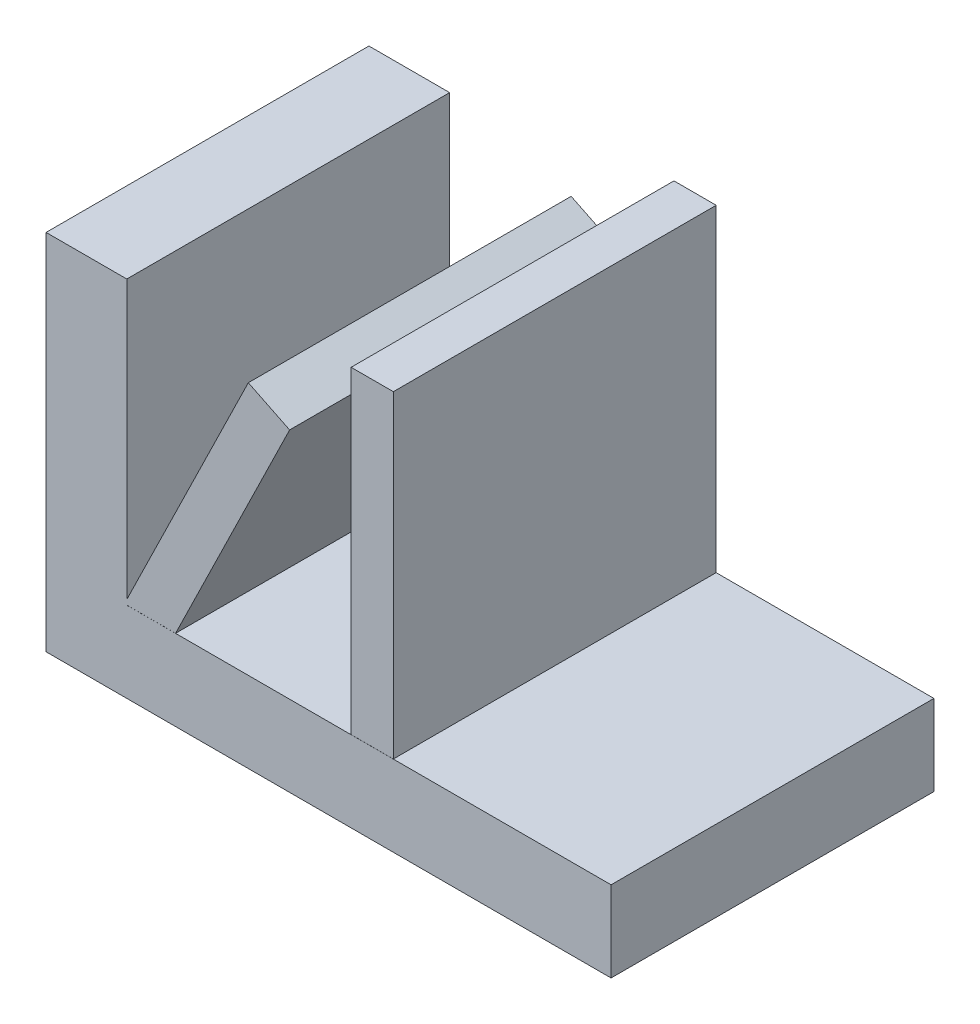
ISO-10303-21;
HEADER;
FILE_DESCRIPTION(('STEP AP214'),'2;1');
FILE_NAME('part.step','',(''),(''),'','','');
FILE_SCHEMA(('AUTOMOTIVE_DESIGN { 1 0 10303 214 1 1 1 1 }'));
ENDSEC;
DATA;
#1=APPLICATION_CONTEXT('core data for automotive mechanical design processes');
#2=APPLICATION_PROTOCOL_DEFINITION('international standard','automotive_design',2000,#1);
#3=PRODUCT_CONTEXT('',#1,'mechanical');
#4=PRODUCT('Part','Part','',(#3));
#5=PRODUCT_RELATED_PRODUCT_CATEGORY('part','',(#4));
#6=PRODUCT_DEFINITION_FORMATION('','',#4);
#7=PRODUCT_DEFINITION_CONTEXT('part definition',#1,'design');
#8=PRODUCT_DEFINITION('design','',#6,#7);
#9=PRODUCT_DEFINITION_SHAPE('','',#8);
#10=(LENGTH_UNIT() NAMED_UNIT(*) SI_UNIT(.MILLI.,.METRE.));
#11=(NAMED_UNIT(*) PLANE_ANGLE_UNIT() SI_UNIT($,.RADIAN.));
#12=(NAMED_UNIT(*) SI_UNIT($,.STERADIAN.) SOLID_ANGLE_UNIT());
#13=UNCERTAINTY_MEASURE_WITH_UNIT(LENGTH_MEASURE(1.E-05),#10,'distance_accuracy_value','');
#14=(GEOMETRIC_REPRESENTATION_CONTEXT(3) GLOBAL_UNCERTAINTY_ASSIGNED_CONTEXT((#13)) GLOBAL_UNIT_ASSIGNED_CONTEXT((#10,
#11,#12)) REPRESENTATION_CONTEXT('',''));
#15=CARTESIAN_POINT('',(0.,0.,0.));
#16=DIRECTION('',(0.,0.,1.));
#17=DIRECTION('',(1.,0.,0.));
#18=AXIS2_PLACEMENT_3D('',#15,#16,#17);
#19=CARTESIAN_POINT('',(43.0249221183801,10.00965732,20.));
#20=DIRECTION('',(-1.,0.,0.));
#21=DIRECTION('',(0.,0.,1.));
#22=AXIS2_PLACEMENT_3D('',#19,#20,#21);
#23=PLANE('',#22);
#24=DIRECTION('',(0.,1.,0.));
#25=VECTOR('',#24,1.);
#26=CARTESIAN_POINT('',(43.0249221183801,10.00965732,-20.));
#27=LINE('',#26,#25);
#28=CARTESIAN_POINT('',(43.0249221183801,10.00965732,-20.));
#29=VERTEX_POINT('',#28);
#30=CARTESIAN_POINT('',(43.0249221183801,49.4236760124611,-20.));
#31=VERTEX_POINT('',#30);
#32=EDGE_CURVE('E87',#29,#31,#27,.T.);
#33=ORIENTED_EDGE('',*,*,#32,.T.);
#34=DIRECTION('',(0.,0.,-1.));
#35=VECTOR('',#34,1.);
#36=CARTESIAN_POINT('',(43.0249221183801,49.4236760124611,20.));
#37=LINE('',#36,#35);
#38=CARTESIAN_POINT('',(43.0249221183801,49.4236760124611,20.));
#39=VERTEX_POINT('',#38);
#40=EDGE_CURVE('E12',#39,#31,#37,.T.);
#41=ORIENTED_EDGE('',*,*,#40,.F.);
#42=DIRECTION('',(0.,1.,0.));
#43=VECTOR('',#42,1.);
#44=CARTESIAN_POINT('',(43.0249221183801,10.00965732,20.));
#45=LINE('',#44,#43);
#46=CARTESIAN_POINT('',(43.0249221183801,10.00965732,20.));
#47=VERTEX_POINT('',#46);
#48=EDGE_CURVE('E105',#47,#39,#45,.T.);
#49=ORIENTED_EDGE('',*,*,#48,.F.);
#50=DIRECTION('',(0.,0.,-1.));
#51=VECTOR('',#50,1.);
#52=CARTESIAN_POINT('',(43.0249221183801,10.00965732,20.));
#53=LINE('',#52,#51);
#54=EDGE_CURVE('E99',#47,#29,#53,.T.);
#55=ORIENTED_EDGE('',*,*,#54,.T.);
#56=EDGE_LOOP('',(#33,#41,#49,#55));
#57=FACE_BOUND('',#56,.T.);
#58=ADVANCED_FACE('F43',(#57),#23,.F.);
#59=CARTESIAN_POINT('',(43.0249221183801,49.4236760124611,20.));
#60=DIRECTION('',(0.,-1.,0.));
#61=DIRECTION('',(0.,0.,-1.));
#62=AXIS2_PLACEMENT_3D('',#59,#60,#61);
#63=PLANE('',#62);
#64=DIRECTION('',(-1.,0.,0.));
#65=VECTOR('',#64,1.);
#66=CARTESIAN_POINT('',(43.0249221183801,49.4236760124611,-20.));
#67=LINE('',#66,#65);
#68=CARTESIAN_POINT('',(37.791277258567,49.4236760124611,-20.));
#69=VERTEX_POINT('',#68);
#70=EDGE_CURVE('E83',#31,#69,#67,.T.);
#71=ORIENTED_EDGE('',*,*,#70,.T.);
#72=DIRECTION('',(0.,0.,-1.));
#73=VECTOR('',#72,1.);
#74=CARTESIAN_POINT('',(37.791277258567,49.4236760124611,20.));
#75=LINE('',#74,#73);
#76=CARTESIAN_POINT('',(37.791277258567,49.4236760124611,20.));
#77=VERTEX_POINT('',#76);
#78=EDGE_CURVE('E50',#77,#69,#75,.T.);
#79=ORIENTED_EDGE('',*,*,#78,.F.);
#80=DIRECTION('',(-1.,0.,0.));
#81=VECTOR('',#80,1.);
#82=CARTESIAN_POINT('',(43.0249221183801,49.4236760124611,20.));
#83=LINE('',#82,#81);
#84=EDGE_CURVE('E95',#39,#77,#83,.T.);
#85=ORIENTED_EDGE('',*,*,#84,.F.);
#86=ORIENTED_EDGE('',*,*,#40,.T.);
#87=EDGE_LOOP('',(#71,#79,#85,#86));
#88=FACE_BOUND('',#87,.T.);
#89=ADVANCED_FACE('F94',(#88),#63,.F.);
#90=CARTESIAN_POINT('',(37.791277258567,10.00965732,20.));
#91=DIRECTION('',(1.,0.,0.));
#92=DIRECTION('',(0.,0.,-1.));
#93=AXIS2_PLACEMENT_3D('',#90,#91,#92);
#94=PLANE('',#93);
#95=DIRECTION('',(0.,-1.,0.));
#96=VECTOR('',#95,1.);
#97=CARTESIAN_POINT('',(37.791277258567,10.00965732,-20.));
#98=LINE('',#97,#96);
#99=CARTESIAN_POINT('',(37.791277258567,10.00965732,-20.));
#100=VERTEX_POINT('',#99);
#101=EDGE_CURVE('E88',#69,#100,#98,.T.);
#102=ORIENTED_EDGE('',*,*,#101,.T.);
#103=DIRECTION('',(0.,0.,-1.));
#104=VECTOR('',#103,1.);
#105=CARTESIAN_POINT('',(37.791277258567,10.00965732,20.));
#106=LINE('',#105,#104);
#107=CARTESIAN_POINT('',(37.791277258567,10.00965732,20.));
#108=VERTEX_POINT('',#107);
#109=EDGE_CURVE('E111',#108,#100,#106,.T.);
#110=ORIENTED_EDGE('',*,*,#109,.F.);
#111=DIRECTION('',(0.,-1.,0.));
#112=VECTOR('',#111,1.);
#113=CARTESIAN_POINT('',(37.791277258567,10.00965732,20.));
#114=LINE('',#113,#112);
#115=EDGE_CURVE('E62',#77,#108,#114,.T.);
#116=ORIENTED_EDGE('',*,*,#115,.F.);
#117=ORIENTED_EDGE('',*,*,#78,.T.);
#118=EDGE_LOOP('',(#102,#110,#116,#117));
#119=FACE_BOUND('',#118,.T.);
#120=ADVANCED_FACE('F114',(#119),#94,.F.);
#121=CARTESIAN_POINT('',(43.0249221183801,10.00965732,20.));
#122=DIRECTION('',(0.,1.,0.));
#123=DIRECTION('',(-1.,0.,0.));
#124=AXIS2_PLACEMENT_3D('',#121,#122,#123);
#125=PLANE('',#124);
#126=DIRECTION('',(1.,0.,0.));
#127=VECTOR('',#126,1.);
#128=CARTESIAN_POINT('',(43.0249221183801,10.00965732,-20.));
#129=LINE('',#128,#127);
#130=EDGE_CURVE('E103',#100,#29,#129,.T.);
#131=ORIENTED_EDGE('',*,*,#130,.T.);
#132=ORIENTED_EDGE('',*,*,#54,.F.);
#133=DIRECTION('',(1.,0.,0.));
#134=VECTOR('',#133,1.);
#135=CARTESIAN_POINT('',(43.0249221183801,10.00965732,20.));
#136=LINE('',#135,#134);
#137=EDGE_CURVE('E57',#108,#47,#136,.T.);
#138=ORIENTED_EDGE('',*,*,#137,.F.);
#139=ORIENTED_EDGE('',*,*,#109,.T.);
#140=EDGE_LOOP('',(#131,#132,#138,#139));
#141=FACE_BOUND('',#140,.T.);
#142=ADVANCED_FACE('F116',(#141),#125,.F.);
#143=CARTESIAN_POINT('',(43.0249221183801,49.4236760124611,20.));
#144=DIRECTION('',(0.,0.,1.));
#145=DIRECTION('',(1.,0.,0.));
#146=AXIS2_PLACEMENT_3D('',#143,#144,#145);
#147=PLANE('',#146);
#148=ORIENTED_EDGE('',*,*,#48,.T.);
#149=ORIENTED_EDGE('',*,*,#84,.T.);
#150=ORIENTED_EDGE('',*,*,#115,.T.);
#151=ORIENTED_EDGE('',*,*,#137,.T.);
#152=EDGE_LOOP('',(#148,#149,#150,#151));
#153=FACE_BOUND('',#152,.T.);
#154=ADVANCED_FACE('F117',(#153),#147,.T.);
#155=CARTESIAN_POINT('',(43.0249221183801,49.4236760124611,-20.));
#156=DIRECTION('',(0.,0.,1.));
#157=DIRECTION('',(1.,0.,0.));
#158=AXIS2_PLACEMENT_3D('',#155,#156,#157);
#159=PLANE('',#158);
#160=ORIENTED_EDGE('',*,*,#32,.F.);
#161=ORIENTED_EDGE('',*,*,#130,.F.);
#162=ORIENTED_EDGE('',*,*,#101,.F.);
#163=ORIENTED_EDGE('',*,*,#70,.F.);
#164=EDGE_LOOP('',(#160,#161,#162,#163));
#165=FACE_BOUND('',#164,.T.);
#166=ADVANCED_FACE('F84',(#165),#159,.F.);
#167=CLOSED_SHELL('',(#58,#89,#120,#142,#154,#166));
#168=MANIFOLD_SOLID_BREP('B2',#167);
#169=CARTESIAN_POINT('',(10.,45.,20.));
#170=DIRECTION('',(-1.,0.,0.));
#171=DIRECTION('',(0.,-1.,0.));
#172=AXIS2_PLACEMENT_3D('',#169,#170,#171);
#173=PLANE('',#172);
#174=DIRECTION('',(0.,0.,-1.));
#175=VECTOR('',#174,1.);
#176=CARTESIAN_POINT('',(10.,10.00965732,20.));
#177=LINE('',#176,#175);
#178=CARTESIAN_POINT('',(10.,10.00965732,20.));
#179=VERTEX_POINT('',#178);
#180=CARTESIAN_POINT('',(10.,10.00965732,-20.));
#181=VERTEX_POINT('',#180);
#182=EDGE_CURVE('E190',#179,#181,#177,.T.);
#183=ORIENTED_EDGE('',*,*,#182,.F.);
#184=DIRECTION('',(0.,1.,0.));
#185=VECTOR('',#184,1.);
#186=CARTESIAN_POINT('',(10.,45.,20.));
#187=LINE('',#186,#185);
#188=CARTESIAN_POINT('',(10.,10.,20.));
#189=VERTEX_POINT('',#188);
#190=EDGE_CURVE('E305',#189,#179,#187,.T.);
#191=ORIENTED_EDGE('',*,*,#190,.F.);
#192=DIRECTION('',(0.,0.,-1.));
#193=VECTOR('',#192,1.);
#194=CARTESIAN_POINT('',(10.,10.,20.));
#195=LINE('',#194,#193);
#196=CARTESIAN_POINT('',(10.,10.,-20.));
#197=VERTEX_POINT('',#196);
#198=EDGE_CURVE('E315',#189,#197,#195,.T.);
#199=ORIENTED_EDGE('',*,*,#198,.T.);
#200=DIRECTION('',(0.,1.,0.));
#201=VECTOR('',#200,1.);
#202=CARTESIAN_POINT('',(10.,45.,-20.));
#203=LINE('',#202,#201);
#204=EDGE_CURVE('E292',#197,#181,#203,.T.);
#205=ORIENTED_EDGE('',*,*,#204,.T.);
#206=EDGE_LOOP('',(#183,#191,#199,#205));
#207=FACE_BOUND('',#206,.T.);
#208=ADVANCED_FACE('F167',(#207),#173,.F.);
#209=DIRECTION('',(0.,0.,1.));
#210=VECTOR('',#209,1.);
#211=CARTESIAN_POINT('',(10.,10.6147636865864,20.));
#212=LINE('',#211,#210);
#213=CARTESIAN_POINT('',(9.99999999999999,10.6147636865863,-20.));
#214=VERTEX_POINT('',#213);
#215=CARTESIAN_POINT('',(10.,10.6147636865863,20.));
#216=VERTEX_POINT('',#215);
#217=EDGE_CURVE('E273',#214,#216,#212,.T.);
#218=ORIENTED_EDGE('',*,*,#217,.F.);
#219=CARTESIAN_POINT('',(10.,45.,-20.));
#220=VERTEX_POINT('',#219);
#221=EDGE_CURVE('E291',#214,#220,#203,.T.);
#222=ORIENTED_EDGE('',*,*,#221,.T.);
#223=DIRECTION('',(0.,0.,-1.));
#224=VECTOR('',#223,1.);
#225=CARTESIAN_POINT('',(10.,45.,20.));
#226=LINE('',#225,#224);
#227=CARTESIAN_POINT('',(10.,45.,20.));
#228=VERTEX_POINT('',#227);
#229=EDGE_CURVE('E312',#228,#220,#226,.T.);
#230=ORIENTED_EDGE('',*,*,#229,.F.);
#231=EDGE_CURVE('E182',#216,#228,#187,.T.);
#232=ORIENTED_EDGE('',*,*,#231,.F.);
#233=EDGE_LOOP('',(#218,#222,#230,#232));
#234=FACE_BOUND('',#233,.T.);
#235=ADVANCED_FACE('F356',(#234),#173,.F.);
#236=CARTESIAN_POINT('',(0.,45.,20.));
#237=DIRECTION('',(1.,0.,0.));
#238=DIRECTION('',(0.,1.,0.));
#239=AXIS2_PLACEMENT_3D('',#236,#237,#238);
#240=PLANE('',#239);
#241=DIRECTION('',(0.,-1.,0.));
#242=VECTOR('',#241,1.);
#243=CARTESIAN_POINT('',(0.,45.,-20.));
#244=LINE('',#243,#242);
#245=CARTESIAN_POINT('',(0.,45.,-20.));
#246=VERTEX_POINT('',#245);
#247=CARTESIAN_POINT('',(0.,0.,-20.));
#248=VERTEX_POINT('',#247);
#249=EDGE_CURVE('E282',#246,#248,#244,.T.);
#250=ORIENTED_EDGE('',*,*,#249,.T.);
#251=DIRECTION('',(0.,0.,-1.));
#252=VECTOR('',#251,1.);
#253=CARTESIAN_POINT('',(0.,0.,20.));
#254=LINE('',#253,#252);
#255=CARTESIAN_POINT('',(0.,0.,20.));
#256=VERTEX_POINT('',#255);
#257=EDGE_CURVE('E41',#256,#248,#254,.T.);
#258=ORIENTED_EDGE('',*,*,#257,.F.);
#259=DIRECTION('',(0.,-1.,0.));
#260=VECTOR('',#259,1.);
#261=CARTESIAN_POINT('',(0.,45.,20.));
#262=LINE('',#261,#260);
#263=CARTESIAN_POINT('',(0.,45.,20.));
#264=VERTEX_POINT('',#263);
#265=EDGE_CURVE('E296',#264,#256,#262,.T.);
#266=ORIENTED_EDGE('',*,*,#265,.F.);
#267=DIRECTION('',(0.,0.,-1.));
#268=VECTOR('',#267,1.);
#269=CARTESIAN_POINT('',(0.,45.,20.));
#270=LINE('',#269,#268);
#271=EDGE_CURVE('E309',#264,#246,#270,.T.);
#272=ORIENTED_EDGE('',*,*,#271,.T.);
#273=EDGE_LOOP('',(#250,#258,#266,#272));
#274=FACE_BOUND('',#273,.T.);
#275=ADVANCED_FACE('F169',(#274),#240,.F.);
#276=CARTESIAN_POINT('',(0.,0.,20.));
#277=DIRECTION('',(0.,1.,0.));
#278=DIRECTION('',(0.,0.,1.));
#279=AXIS2_PLACEMENT_3D('',#276,#277,#278);
#280=PLANE('',#279);
#281=DIRECTION('',(1.,0.,0.));
#282=VECTOR('',#281,1.);
#283=CARTESIAN_POINT('',(0.,0.,-20.));
#284=LINE('',#283,#282);
#285=CARTESIAN_POINT('',(70.,0.,-20.));
#286=VERTEX_POINT('',#285);
#287=EDGE_CURVE('E285',#248,#286,#284,.T.);
#288=ORIENTED_EDGE('',*,*,#287,.T.);
#289=DIRECTION('',(0.,0.,-1.));
#290=VECTOR('',#289,1.);
#291=CARTESIAN_POINT('',(70.,0.,20.));
#292=LINE('',#291,#290);
#293=CARTESIAN_POINT('',(70.,0.,20.));
#294=VERTEX_POINT('',#293);
#295=EDGE_CURVE('E175',#294,#286,#292,.T.);
#296=ORIENTED_EDGE('',*,*,#295,.F.);
#297=DIRECTION('',(1.,0.,0.));
#298=VECTOR('',#297,1.);
#299=CARTESIAN_POINT('',(0.,0.,20.));
#300=LINE('',#299,#298);
#301=EDGE_CURVE('E299',#256,#294,#300,.T.);
#302=ORIENTED_EDGE('',*,*,#301,.F.);
#303=ORIENTED_EDGE('',*,*,#257,.T.);
#304=EDGE_LOOP('',(#288,#296,#302,#303));
#305=FACE_BOUND('',#304,.T.);
#306=ADVANCED_FACE('F377',(#305),#280,.F.);
#307=CARTESIAN_POINT('',(70.,10.,20.));
#308=DIRECTION('',(-1.,0.,0.));
#309=DIRECTION('',(0.,0.,1.));
#310=AXIS2_PLACEMENT_3D('',#307,#308,#309);
#311=PLANE('',#310);
#312=DIRECTION('',(0.,1.,0.));
#313=VECTOR('',#312,1.);
#314=CARTESIAN_POINT('',(70.,10.,-20.));
#315=LINE('',#314,#313);
#316=CARTESIAN_POINT('',(70.,10.,-20.));
#317=VERTEX_POINT('',#316);
#318=EDGE_CURVE('E287',#286,#317,#315,.T.);
#319=ORIENTED_EDGE('',*,*,#318,.T.);
#320=DIRECTION('',(0.,0.,-1.));
#321=VECTOR('',#320,1.);
#322=CARTESIAN_POINT('',(70.,10.,20.));
#323=LINE('',#322,#321);
#324=CARTESIAN_POINT('',(70.,10.,20.));
#325=VERTEX_POINT('',#324);
#326=EDGE_CURVE('E318',#325,#317,#323,.T.);
#327=ORIENTED_EDGE('',*,*,#326,.F.);
#328=DIRECTION('',(0.,1.,0.));
#329=VECTOR('',#328,1.);
#330=CARTESIAN_POINT('',(70.,10.,20.));
#331=LINE('',#330,#329);
#332=EDGE_CURVE('E301',#294,#325,#331,.T.);
#333=ORIENTED_EDGE('',*,*,#332,.F.);
#334=ORIENTED_EDGE('',*,*,#295,.T.);
#335=EDGE_LOOP('',(#319,#327,#333,#334));
#336=FACE_BOUND('',#335,.T.);
#337=ADVANCED_FACE('F325',(#336),#311,.F.);
#338=CARTESIAN_POINT('',(10.,10.,20.));
#339=DIRECTION('',(0.,-1.,0.));
#340=DIRECTION('',(0.,0.,-1.));
#341=AXIS2_PLACEMENT_3D('',#338,#339,#340);
#342=PLANE('',#341);
#343=DIRECTION('',(-1.,0.,0.));
#344=VECTOR('',#343,1.);
#345=CARTESIAN_POINT('',(10.,10.,-20.));
#346=LINE('',#345,#344);
#347=EDGE_CURVE('E289',#317,#197,#346,.T.);
#348=ORIENTED_EDGE('',*,*,#347,.T.);
#349=ORIENTED_EDGE('',*,*,#198,.F.);
#350=DIRECTION('',(-1.,0.,0.));
#351=VECTOR('',#350,1.);
#352=CARTESIAN_POINT('',(10.,10.,20.));
#353=LINE('',#352,#351);
#354=EDGE_CURVE('E303',#325,#189,#353,.T.);
#355=ORIENTED_EDGE('',*,*,#354,.F.);
#356=ORIENTED_EDGE('',*,*,#326,.T.);
#357=EDGE_LOOP('',(#348,#349,#355,#356));
#358=FACE_BOUND('',#357,.T.);
#359=ADVANCED_FACE('F332',(#358),#342,.F.);
#360=CARTESIAN_POINT('',(0.,45.,20.));
#361=DIRECTION('',(0.,-1.,0.));
#362=DIRECTION('',(0.,0.,-1.));
#363=AXIS2_PLACEMENT_3D('',#360,#361,#362);
#364=PLANE('',#363);
#365=DIRECTION('',(-1.,0.,0.));
#366=VECTOR('',#365,1.);
#367=CARTESIAN_POINT('',(0.,45.,-20.));
#368=LINE('',#367,#366);
#369=EDGE_CURVE('E294',#220,#246,#368,.T.);
#370=ORIENTED_EDGE('',*,*,#369,.T.);
#371=ORIENTED_EDGE('',*,*,#271,.F.);
#372=DIRECTION('',(-1.,0.,0.));
#373=VECTOR('',#372,1.);
#374=CARTESIAN_POINT('',(0.,45.,20.));
#375=LINE('',#374,#373);
#376=EDGE_CURVE('E307',#228,#264,#375,.T.);
#377=ORIENTED_EDGE('',*,*,#376,.F.);
#378=ORIENTED_EDGE('',*,*,#229,.T.);
#379=EDGE_LOOP('',(#370,#371,#377,#378));
#380=FACE_BOUND('',#379,.T.);
#381=ADVANCED_FACE('F372',(#380),#364,.F.);
#382=CARTESIAN_POINT('',(0.,0.,20.));
#383=DIRECTION('',(0.,0.,1.));
#384=DIRECTION('',(1.,0.,0.));
#385=AXIS2_PLACEMENT_3D('',#382,#383,#384);
#386=PLANE('',#385);
#387=ORIENTED_EDGE('',*,*,#190,.T.);
#388=DIRECTION('',(1.,0.,0.));
#389=VECTOR('',#388,1.);
#390=CARTESIAN_POINT('',(16.0469032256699,10.00965732,20.));
#391=LINE('',#390,#389);
#392=CARTESIAN_POINT('',(16.0469032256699,10.00965732,20.));
#393=VERTEX_POINT('',#392);
#394=EDGE_CURVE('E336',#179,#393,#391,.T.);
#395=ORIENTED_EDGE('',*,*,#394,.T.);
#396=DIRECTION('',(0.439354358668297,0.898313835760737,0.));
#397=VECTOR('',#396,1.);
#398=CARTESIAN_POINT('',(30.1745528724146,38.8953685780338,20.));
#399=LINE('',#398,#397);
#400=CARTESIAN_POINT('',(30.1745528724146,38.8953685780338,20.));
#401=VERTEX_POINT('',#400);
#402=EDGE_CURVE('E272',#393,#401,#399,.T.);
#403=ORIENTED_EDGE('',*,*,#402,.T.);
#404=DIRECTION('',(-0.898313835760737,0.439354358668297,0.));
#405=VECTOR('',#404,1.);
#406=CARTESIAN_POINT('',(25.0560747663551,41.398753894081,20.));
#407=LINE('',#406,#405);
#408=CARTESIAN_POINT('',(25.0560747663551,41.398753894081,20.));
#409=VERTEX_POINT('',#408);
#410=EDGE_CURVE('E339',#401,#409,#407,.T.);
#411=ORIENTED_EDGE('',*,*,#410,.T.);
#412=DIRECTION('',(-0.439354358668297,-0.898313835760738,0.));
#413=VECTOR('',#412,1.);
#414=CARTESIAN_POINT('',(9.70404984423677,10.00965732,20.));
#415=LINE('',#414,#413);
#416=EDGE_CURVE('E346',#409,#216,#415,.T.);
#417=ORIENTED_EDGE('',*,*,#416,.T.);
#418=ORIENTED_EDGE('',*,*,#231,.T.);
#419=ORIENTED_EDGE('',*,*,#376,.T.);
#420=ORIENTED_EDGE('',*,*,#265,.T.);
#421=ORIENTED_EDGE('',*,*,#301,.T.);
#422=ORIENTED_EDGE('',*,*,#332,.T.);
#423=ORIENTED_EDGE('',*,*,#354,.T.);
#424=EDGE_LOOP('',(#387,#395,#403,#411,#417,#418,#419,#420,#421,#422,#423));
#425=FACE_BOUND('',#424,.T.);
#426=ADVANCED_FACE('F335',(#425),#386,.T.);
#427=CARTESIAN_POINT('',(0.,0.,-20.));
#428=DIRECTION('',(0.,0.,1.));
#429=DIRECTION('',(1.,0.,0.));
#430=AXIS2_PLACEMENT_3D('',#427,#428,#429);
#431=PLANE('',#430);
#432=ORIENTED_EDGE('',*,*,#221,.F.);
#433=DIRECTION('',(-0.439354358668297,-0.898313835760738,0.));
#434=VECTOR('',#433,1.);
#435=CARTESIAN_POINT('',(9.70404984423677,10.00965732,-20.));
#436=LINE('',#435,#434);
#437=CARTESIAN_POINT('',(25.0560747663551,41.398753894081,-20.));
#438=VERTEX_POINT('',#437);
#439=EDGE_CURVE('E337',#438,#214,#436,.T.);
#440=ORIENTED_EDGE('',*,*,#439,.F.);
#441=DIRECTION('',(-0.898313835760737,0.439354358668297,0.));
#442=VECTOR('',#441,1.);
#443=CARTESIAN_POINT('',(25.0560747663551,41.398753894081,-20.));
#444=LINE('',#443,#442);
#445=CARTESIAN_POINT('',(30.1745528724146,38.8953685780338,-20.));
#446=VERTEX_POINT('',#445);
#447=EDGE_CURVE('E265',#446,#438,#444,.T.);
#448=ORIENTED_EDGE('',*,*,#447,.F.);
#449=DIRECTION('',(0.439354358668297,0.898313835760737,0.));
#450=VECTOR('',#449,1.);
#451=CARTESIAN_POINT('',(30.1745528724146,38.8953685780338,-20.));
#452=LINE('',#451,#450);
#453=CARTESIAN_POINT('',(16.0469032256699,10.00965732,-20.));
#454=VERTEX_POINT('',#453);
#455=EDGE_CURVE('E260',#454,#446,#452,.T.);
#456=ORIENTED_EDGE('',*,*,#455,.F.);
#457=DIRECTION('',(1.,0.,0.));
#458=VECTOR('',#457,1.);
#459=CARTESIAN_POINT('',(16.0469032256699,10.00965732,-20.));
#460=LINE('',#459,#458);
#461=EDGE_CURVE('E252',#181,#454,#460,.T.);
#462=ORIENTED_EDGE('',*,*,#461,.F.);
#463=ORIENTED_EDGE('',*,*,#204,.F.);
#464=ORIENTED_EDGE('',*,*,#347,.F.);
#465=ORIENTED_EDGE('',*,*,#318,.F.);
#466=ORIENTED_EDGE('',*,*,#287,.F.);
#467=ORIENTED_EDGE('',*,*,#249,.F.);
#468=ORIENTED_EDGE('',*,*,#369,.F.);
#469=EDGE_LOOP('',(#432,#440,#448,#456,#462,#463,#464,#465,#466,#467,#468));
#470=FACE_BOUND('',#469,.T.);
#471=ADVANCED_FACE('F263',(#470),#431,.F.);
#472=CARTESIAN_POINT('',(16.0469032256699,10.00965732,20.));
#473=DIRECTION('',(0.,1.,0.));
#474=DIRECTION('',(0.,0.,1.));
#475=AXIS2_PLACEMENT_3D('',#472,#473,#474);
#476=PLANE('',#475);
#477=ORIENTED_EDGE('',*,*,#394,.F.);
#478=ORIENTED_EDGE('',*,*,#182,.T.);
#479=ORIENTED_EDGE('',*,*,#461,.T.);
#480=DIRECTION('',(0.,0.,-1.));
#481=VECTOR('',#480,1.);
#482=CARTESIAN_POINT('',(16.0469032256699,10.00965732,20.));
#483=LINE('',#482,#481);
#484=EDGE_CURVE('E257',#393,#454,#483,.T.);
#485=ORIENTED_EDGE('',*,*,#484,.F.);
#486=EDGE_LOOP('',(#477,#478,#479,#485));
#487=FACE_BOUND('',#486,.T.);
#488=ADVANCED_FACE('F255',(#487),#476,.F.);
#489=CARTESIAN_POINT('',(9.70404984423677,10.00965732,20.));
#490=DIRECTION('',(0.898313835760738,-0.439354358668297,0.));
#491=DIRECTION('',(0.439354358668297,0.898313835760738,0.));
#492=AXIS2_PLACEMENT_3D('',#489,#490,#491);
#493=PLANE('',#492);
#494=ORIENTED_EDGE('',*,*,#439,.T.);
#495=ORIENTED_EDGE('',*,*,#217,.T.);
#496=ORIENTED_EDGE('',*,*,#416,.F.);
#497=DIRECTION('',(0.,0.,-1.));
#498=VECTOR('',#497,1.);
#499=CARTESIAN_POINT('',(25.0560747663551,41.398753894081,20.));
#500=LINE('',#499,#498);
#501=EDGE_CURVE('E277',#409,#438,#500,.T.);
#502=ORIENTED_EDGE('',*,*,#501,.T.);
#503=EDGE_LOOP('',(#494,#495,#496,#502));
#504=FACE_BOUND('',#503,.T.);
#505=ADVANCED_FACE('F352',(#504),#493,.F.);
#506=CARTESIAN_POINT('',(30.1745528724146,38.8953685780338,20.));
#507=DIRECTION('',(-0.898313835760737,0.439354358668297,0.));
#508=DIRECTION('',(-0.439354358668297,-0.898313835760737,0.));
#509=AXIS2_PLACEMENT_3D('',#506,#507,#508);
#510=PLANE('',#509);
#511=ORIENTED_EDGE('',*,*,#455,.T.);
#512=DIRECTION('',(0.,0.,-1.));
#513=VECTOR('',#512,1.);
#514=CARTESIAN_POINT('',(30.1745528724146,38.8953685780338,20.));
#515=LINE('',#514,#513);
#516=EDGE_CURVE('E274',#401,#446,#515,.T.);
#517=ORIENTED_EDGE('',*,*,#516,.F.);
#518=ORIENTED_EDGE('',*,*,#402,.F.);
#519=ORIENTED_EDGE('',*,*,#484,.T.);
#520=EDGE_LOOP('',(#511,#517,#518,#519));
#521=FACE_BOUND('',#520,.T.);
#522=ADVANCED_FACE('F271',(#521),#510,.F.);
#523=CARTESIAN_POINT('',(25.0560747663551,41.398753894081,20.));
#524=DIRECTION('',(-0.439354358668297,-0.898313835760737,0.));
#525=DIRECTION('',(0.898313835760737,-0.439354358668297,0.));
#526=AXIS2_PLACEMENT_3D('',#523,#524,#525);
#527=PLANE('',#526);
#528=ORIENTED_EDGE('',*,*,#447,.T.);
#529=ORIENTED_EDGE('',*,*,#501,.F.);
#530=ORIENTED_EDGE('',*,*,#410,.F.);
#531=ORIENTED_EDGE('',*,*,#516,.T.);
#532=EDGE_LOOP('',(#528,#529,#530,#531));
#533=FACE_BOUND('',#532,.T.);
#534=ADVANCED_FACE('F357',(#533),#527,.F.);
#535=CLOSED_SHELL('',(#208,#235,#275,#306,#337,#359,#381,#426,#471,#488,#505,#522,#534));
#536=MANIFOLD_SOLID_BREP('B6',#535);
#537=ADVANCED_BREP_SHAPE_REPRESENTATION('',(#18,#168,#536),#14);
#538=SHAPE_DEFINITION_REPRESENTATION(#9,#537);
ENDSEC;
END-ISO-10303-21;
